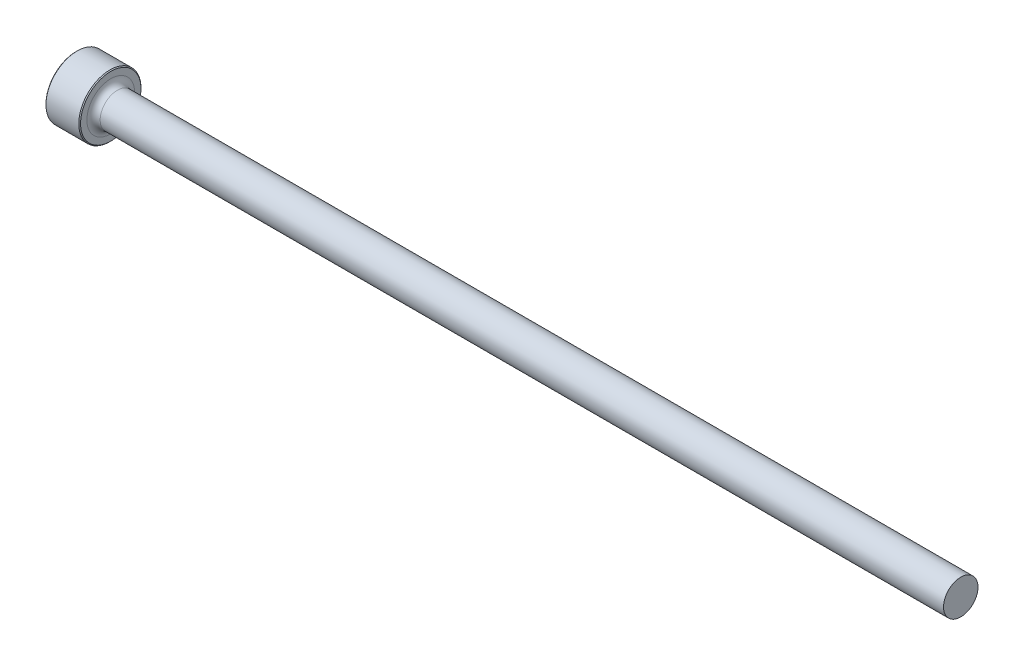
ISO-10303-21;
HEADER;
FILE_DESCRIPTION(('STEP AP214'),'2;1');
FILE_NAME('part.step','',(''),(''),'','','');
FILE_SCHEMA(('AUTOMOTIVE_DESIGN { 1 0 10303 214 1 1 1 1 }'));
ENDSEC;
DATA;
#1=APPLICATION_CONTEXT('core data for automotive mechanical design processes');
#2=APPLICATION_PROTOCOL_DEFINITION('international standard','automotive_design',2000,#1);
#3=PRODUCT_CONTEXT('',#1,'mechanical');
#4=PRODUCT('Part','Part','',(#3));
#5=PRODUCT_RELATED_PRODUCT_CATEGORY('part','',(#4));
#6=PRODUCT_DEFINITION_FORMATION('','',#4);
#7=PRODUCT_DEFINITION_CONTEXT('part definition',#1,'design');
#8=PRODUCT_DEFINITION('design','',#6,#7);
#9=PRODUCT_DEFINITION_SHAPE('','',#8);
#10=(LENGTH_UNIT() NAMED_UNIT(*) SI_UNIT(.MILLI.,.METRE.));
#11=(NAMED_UNIT(*) PLANE_ANGLE_UNIT() SI_UNIT($,.RADIAN.));
#12=(NAMED_UNIT(*) SI_UNIT($,.STERADIAN.) SOLID_ANGLE_UNIT());
#13=UNCERTAINTY_MEASURE_WITH_UNIT(LENGTH_MEASURE(1.E-05),#10,'distance_accuracy_value','');
#14=(GEOMETRIC_REPRESENTATION_CONTEXT(3) GLOBAL_UNCERTAINTY_ASSIGNED_CONTEXT((#13)) GLOBAL_UNIT_ASSIGNED_CONTEXT((#10,
#11,#12)) REPRESENTATION_CONTEXT('',''));
#15=CARTESIAN_POINT('',(0.,0.,0.));
#16=DIRECTION('',(0.,0.,1.));
#17=DIRECTION('',(1.,0.,0.));
#18=AXIS2_PLACEMENT_3D('',#15,#16,#17);
#19=CARTESIAN_POINT('',(101.6,1.98056499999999,0.));
#20=DIRECTION('',(1.,0.,0.));
#21=DIRECTION('',(0.,1.,0.));
#22=AXIS2_PLACEMENT_3D('',#19,#20,#21);
#23=PLANE('',#22);
#24=CARTESIAN_POINT('',(101.6,0.,0.));
#25=DIRECTION('',(1.,0.,0.));
#26=DIRECTION('',(0.,1.,0.));
#27=AXIS2_PLACEMENT_3D('',#24,#25,#26);
#28=CIRCLE('',#27,1.980565);
#29=CARTESIAN_POINT('',(101.6,1.98056499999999,0.));
#30=VERTEX_POINT('',#29);
#31=EDGE_CURVE('E50',#30,#30,#28,.T.);
#32=ORIENTED_EDGE('',*,*,#31,.T.);
#33=EDGE_LOOP('',(#32));
#34=FACE_BOUND('',#33,.T.);
#35=ADVANCED_FACE('F30',(#34),#23,.T.);
#36=CARTESIAN_POINT('',(101.6,0.,0.));
#37=DIRECTION('',(1.,0.,0.));
#38=DIRECTION('',(0.,1.,0.));
#39=AXIS2_PLACEMENT_3D('',#36,#37,#38);
#40=CYLINDRICAL_SURFACE('',#39,1.980565);
#41=CARTESIAN_POINT('',(4.73075000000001,0.,0.));
#42=DIRECTION('',(1.,0.,0.));
#43=DIRECTION('',(0.,1.,0.));
#44=AXIS2_PLACEMENT_3D('',#41,#42,#43);
#45=CIRCLE('',#44,1.98056499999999);
#46=CARTESIAN_POINT('',(4.73075000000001,1.98056499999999,0.));
#47=VERTEX_POINT('',#46);
#48=EDGE_CURVE('E53',#47,#47,#45,.T.);
#49=ORIENTED_EDGE('',*,*,#48,.T.);
#50=EDGE_LOOP('',(#49));
#51=FACE_BOUND('',#50,.T.);
#52=ORIENTED_EDGE('',*,*,#31,.F.);
#53=EDGE_LOOP('',(#52));
#54=FACE_BOUND('',#53,.T.);
#55=ADVANCED_FACE('F74',(#51,#54),#40,.T.);
#56=CARTESIAN_POINT('',(4.73075,0.,0.));
#57=DIRECTION('',(1.,0.,0.));
#58=DIRECTION('',(0.,1.,0.));
#59=AXIS2_PLACEMENT_3D('',#56,#57,#58);
#60=TOROIDAL_SURFACE('',#59,2.74256499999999,0.762);
#61=CARTESIAN_POINT('',(3.96874999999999,0.,0.));
#62=DIRECTION('',(1.,0.,0.));
#63=DIRECTION('',(0.,1.,0.));
#64=AXIS2_PLACEMENT_3D('',#61,#62,#63);
#65=CIRCLE('',#64,2.74256499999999);
#66=CARTESIAN_POINT('',(3.96874999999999,2.74256499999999,0.));
#67=VERTEX_POINT('',#66);
#68=EDGE_CURVE('E56',#67,#67,#65,.T.);
#69=ORIENTED_EDGE('',*,*,#68,.T.);
#70=EDGE_LOOP('',(#69));
#71=FACE_BOUND('',#70,.T.);
#72=ORIENTED_EDGE('',*,*,#48,.F.);
#73=EDGE_LOOP('',(#72));
#74=FACE_BOUND('',#73,.T.);
#75=ADVANCED_FACE('F60',(#71,#74),#60,.F.);
#76=CARTESIAN_POINT('',(3.96875,3.571875,0.));
#77=DIRECTION('',(1.,0.,0.));
#78=DIRECTION('',(0.,1.,0.));
#79=AXIS2_PLACEMENT_3D('',#76,#77,#78);
#80=PLANE('',#79);
#81=CARTESIAN_POINT('',(3.96875,0.,0.));
#82=DIRECTION('',(1.,0.,0.));
#83=DIRECTION('',(0.,1.,0.));
#84=AXIS2_PLACEMENT_3D('',#81,#82,#83);
#85=CIRCLE('',#84,3.470275);
#86=CARTESIAN_POINT('',(3.96875,3.470275,0.));
#87=VERTEX_POINT('',#86);
#88=EDGE_CURVE('E10',#87,#87,#85,.T.);
#89=ORIENTED_EDGE('',*,*,#88,.T.);
#90=EDGE_LOOP('',(#89));
#91=FACE_BOUND('',#90,.T.);
#92=ORIENTED_EDGE('',*,*,#68,.F.);
#93=EDGE_LOOP('',(#92));
#94=FACE_BOUND('',#93,.T.);
#95=ADVANCED_FACE('F63',(#91,#94),#80,.T.);
#96=CARTESIAN_POINT('',(101.6,0.,0.));
#97=DIRECTION('',(1.,0.,0.));
#98=DIRECTION('',(0.,1.,0.));
#99=AXIS2_PLACEMENT_3D('',#96,#97,#98);
#100=CYLINDRICAL_SURFACE('',#99,3.571875);
#101=CARTESIAN_POINT('',(0.101600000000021,0.,0.));
#102=DIRECTION('',(-1.,0.,0.));
#103=DIRECTION('',(0.,-1.,0.));
#104=AXIS2_PLACEMENT_3D('',#101,#102,#103);
#105=CIRCLE('',#104,3.571875);
#106=CARTESIAN_POINT('',(0.101600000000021,-3.571875,0.));
#107=VERTEX_POINT('',#106);
#108=EDGE_CURVE('E41',#107,#107,#105,.F.);
#109=ORIENTED_EDGE('',*,*,#108,.T.);
#110=EDGE_LOOP('',(#109));
#111=FACE_BOUND('',#110,.T.);
#112=CARTESIAN_POINT('',(3.86715,0.,0.));
#113=DIRECTION('',(1.,0.,0.));
#114=DIRECTION('',(0.,1.,0.));
#115=AXIS2_PLACEMENT_3D('',#112,#113,#114);
#116=CIRCLE('',#115,3.571875);
#117=CARTESIAN_POINT('',(3.86715,3.571875,0.));
#118=VERTEX_POINT('',#117);
#119=EDGE_CURVE('E45',#118,#118,#116,.F.);
#120=ORIENTED_EDGE('',*,*,#119,.T.);
#121=EDGE_LOOP('',(#120));
#122=FACE_BOUND('',#121,.T.);
#123=ADVANCED_FACE('F65',(#111,#122),#100,.T.);
#124=CARTESIAN_POINT('',(0.,0.,0.));
#125=DIRECTION('',(-1.,0.,0.));
#126=DIRECTION('',(0.,-1.,0.));
#127=AXIS2_PLACEMENT_3D('',#124,#125,#126);
#128=PLANE('',#127);
#129=CARTESIAN_POINT('',(0.,0.,0.));
#130=DIRECTION('',(-1.,0.,0.));
#131=DIRECTION('',(0.,-1.,0.));
#132=AXIS2_PLACEMENT_3D('',#129,#130,#131);
#133=CIRCLE('',#132,3.47027499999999);
#134=CARTESIAN_POINT('',(0.,-3.47027499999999,0.));
#135=VERTEX_POINT('',#134);
#136=EDGE_CURVE('E37',#135,#135,#133,.T.);
#137=ORIENTED_EDGE('',*,*,#136,.T.);
#138=EDGE_LOOP('',(#137));
#139=FACE_BOUND('',#138,.T.);
#140=ADVANCED_FACE('F71',(#139),#128,.T.);
#141=CARTESIAN_POINT('',(0.101600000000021,0.,0.));
#142=DIRECTION('',(1.,0.,0.));
#143=DIRECTION('',(0.,1.,0.));
#144=AXIS2_PLACEMENT_3D('',#141,#142,#143);
#145=CONICAL_SURFACE('',#144,3.571875,0.785398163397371);
#146=ORIENTED_EDGE('',*,*,#136,.F.);
#147=EDGE_LOOP('',(#146));
#148=FACE_BOUND('',#147,.T.);
#149=ORIENTED_EDGE('',*,*,#108,.F.);
#150=EDGE_LOOP('',(#149));
#151=FACE_BOUND('',#150,.T.);
#152=ADVANCED_FACE('F84',(#148,#151),#145,.T.);
#153=CARTESIAN_POINT('',(3.96874999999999,0.,0.));
#154=DIRECTION('',(-1.,0.,0.));
#155=DIRECTION('',(0.,-1.,0.));
#156=AXIS2_PLACEMENT_3D('',#153,#154,#155);
#157=CONICAL_SURFACE('',#156,3.47027500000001,0.78539816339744);
#158=ORIENTED_EDGE('',*,*,#119,.F.);
#159=EDGE_LOOP('',(#158));
#160=FACE_BOUND('',#159,.T.);
#161=ORIENTED_EDGE('',*,*,#88,.F.);
#162=EDGE_LOOP('',(#161));
#163=FACE_BOUND('',#162,.T.);
#164=ADVANCED_FACE('F32',(#160,#163),#157,.T.);
#165=CLOSED_SHELL('',(#35,#55,#75,#95,#123,#140,#152,#164));
#166=MANIFOLD_SOLID_BREP('B2',#165);
#167=ADVANCED_BREP_SHAPE_REPRESENTATION('',(#18,#166),#14);
#168=SHAPE_DEFINITION_REPRESENTATION(#9,#167);
ENDSEC;
END-ISO-10303-21;
